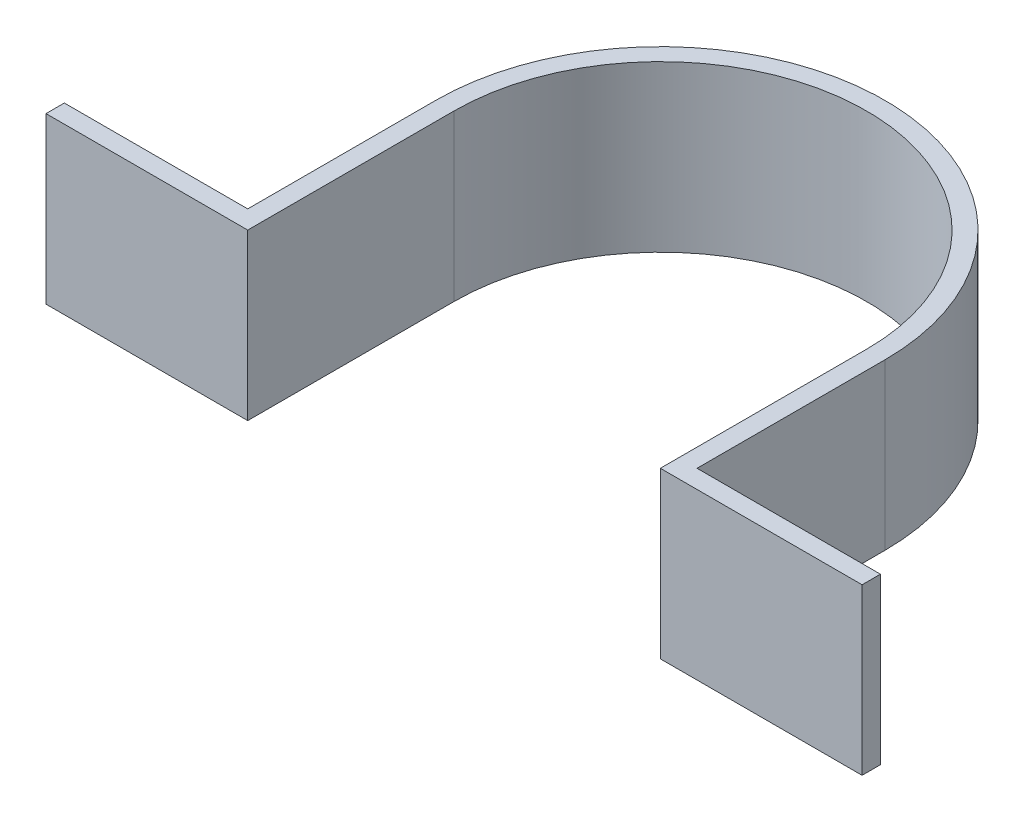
from build123d import *

# Parameters (mm, degrees)
BOSS_EXTRUDE1_DEPTH = 18


with BuildPart() as part:
    # Sketch1 → Boss-Extrude1 (new body)
    with BuildSketch(Plane(origin=(0, 0, 0), x_dir=(1, 0, 0), z_dir=(0, 1, 0))):
        with BuildLine():
            Line((22.5, 0), (22.5, -22.5))
            Line((22.5, -22.5), (44.5, -22.5))
            Line((44.5, -22.5), (44.5, -20.5))
            Line((44.5, -20.5), (24.5, -20.5))
            Line((24.5, -20.5), (24.5, 0))
            ThreePointArc((24.5, 0), (0, 24.5), (-24.5, 0))
            Line((-24.5, 0), (-24.5, -20.5))
            Line((-24.5, -20.5), (-44.5, -20.5))
            Line((-44.5, -20.5), (-44.5, -22.5))
            Line((-44.5, -22.5), (-22.5, -22.5))
            Line((-22.5, -22.5), (-22.5, 0))
            ThreePointArc((-22.5, 0), (0, 22.5), (22.5, 0))
        make_face()
    extrude(amount=BOSS_EXTRUDE1_DEPTH)


solid = part.part
